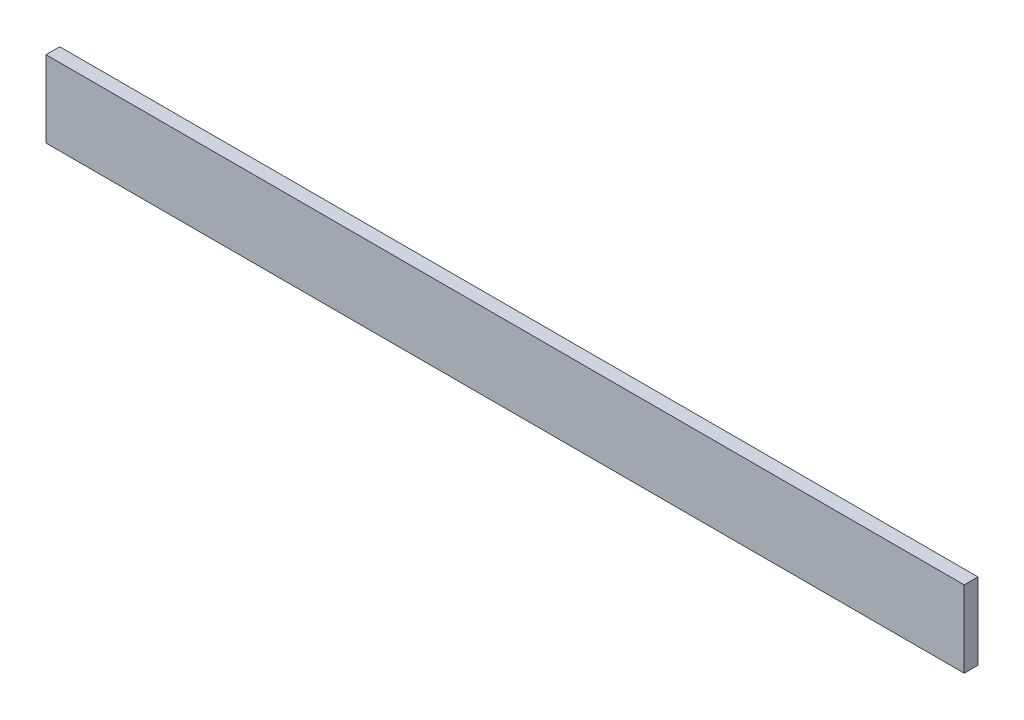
from build123d import *

# Parameters (mm, degrees)
SKETCH1_W           = 1200
SKETCH1_H           = 100
BOSS_EXTRUDE1_DEPTH = 18


with BuildPart() as part:
    # Sketch1 → Boss-Extrude1 (new body)
    with BuildSketch(Plane.XY):
        Rectangle(SKETCH1_W, SKETCH1_H)
    extrude(amount=BOSS_EXTRUDE1_DEPTH)


solid = part.part
